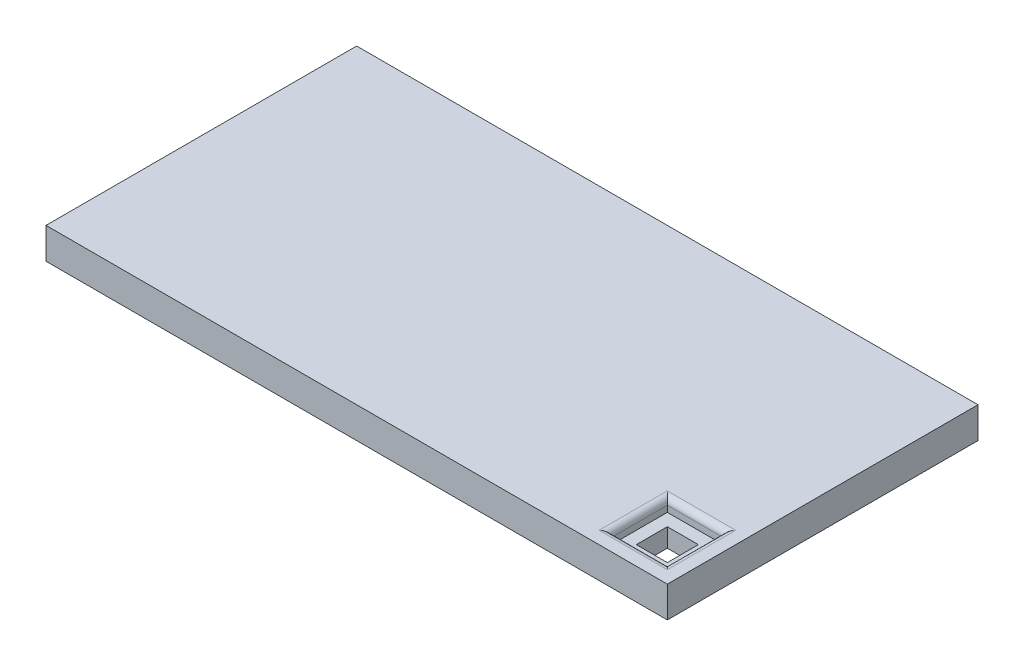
from build123d import *

# Parameters (mm, degrees)
SKETCH1_W          = 100
SKETCH1_H          = 50
EXTRUDE1_DEPTH     = 5
SKETCH2_W          = 5
SKETCH2_H          = 5
CUT_EXTRUDE1_DEPTH = 5
SKETCH3_W          = 9
SKETCH3_H          = 9
CUT_EXTRUDE2_DEPTH = 2
FILLET2_R          = 1


with BuildPart() as part:
    # Sketch1 → Extrude1 (new body)
    with BuildSketch(Plane(origin=(0, 0, 0), x_dir=(1, 0, 0), z_dir=(0, 1, 0))):
        with Locations((-50, 25)):
            Rectangle(SKETCH1_W, SKETCH1_H)
    extrude(amount=EXTRUDE1_DEPTH)

    # Sketch2 → Cut-Extrude1 (cut)
    with BuildSketch(Plane(origin=(0, 5, 0), x_dir=(-1, 0, 0), z_dir=(0, 1, 0))):
        with Locations((7.5, -7.5)):
            Rectangle(SKETCH2_W, SKETCH2_H)
    extrude(amount=-CUT_EXTRUDE1_DEPTH, mode=Mode.SUBTRACT)

    # Sketch3 → Cut-Extrude2 (cut)
    with BuildSketch(Plane(origin=(0, 5, 0), x_dir=(-1, 0, 0), z_dir=(0, 1, 0))):
        with Locations((7.5, -7.5)):
            Rectangle(SKETCH3_W, SKETCH3_H)
    extrude(amount=-CUT_EXTRUDE2_DEPTH, mode=Mode.SUBTRACT)

    # Fillet2
    fillet2_edges = [part.edges().sort_by_distance(p)[0] for p in [
        (-7.5, 5, -3),
        (-3, 5, -7.5),
        (-7.5, 5, -12),
        (-12, 5, -7.5),
    ]]
    fillet(fillet2_edges, radius=FILLET2_R)


solid = part.part
